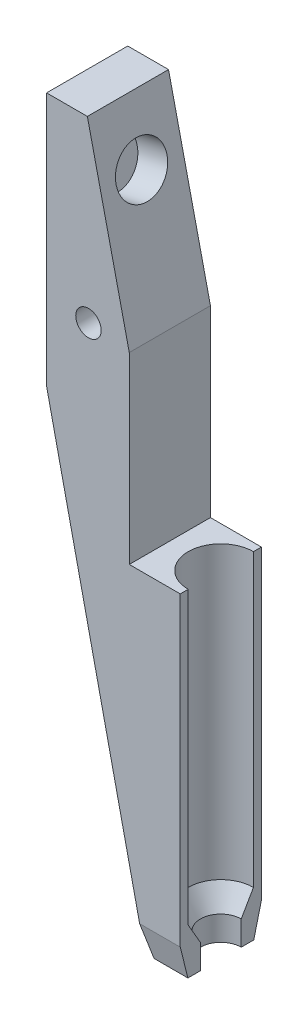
ISO-10303-21;
HEADER;
FILE_DESCRIPTION(('STEP AP214'),'2;1');
FILE_NAME('part.step','',(''),(''),'','','');
FILE_SCHEMA(('AUTOMOTIVE_DESIGN { 1 0 10303 214 1 1 1 1 }'));
ENDSEC;
DATA;
#1=APPLICATION_CONTEXT('core data for automotive mechanical design processes');
#2=APPLICATION_PROTOCOL_DEFINITION('international standard','automotive_design',2000,#1);
#3=PRODUCT_CONTEXT('',#1,'mechanical');
#4=PRODUCT('Part','Part','',(#3));
#5=PRODUCT_RELATED_PRODUCT_CATEGORY('part','',(#4));
#6=PRODUCT_DEFINITION_FORMATION('','',#4);
#7=PRODUCT_DEFINITION_CONTEXT('part definition',#1,'design');
#8=PRODUCT_DEFINITION('design','',#6,#7);
#9=PRODUCT_DEFINITION_SHAPE('','',#8);
#10=(LENGTH_UNIT() NAMED_UNIT(*) SI_UNIT(.MILLI.,.METRE.));
#11=(NAMED_UNIT(*) PLANE_ANGLE_UNIT() SI_UNIT($,.RADIAN.));
#12=(NAMED_UNIT(*) SI_UNIT($,.STERADIAN.) SOLID_ANGLE_UNIT());
#13=UNCERTAINTY_MEASURE_WITH_UNIT(LENGTH_MEASURE(1.E-05),#10,'distance_accuracy_value','');
#14=(GEOMETRIC_REPRESENTATION_CONTEXT(3) GLOBAL_UNCERTAINTY_ASSIGNED_CONTEXT((#13)) GLOBAL_UNIT_ASSIGNED_CONTEXT((#10,
#11,#12)) REPRESENTATION_CONTEXT('',''));
#15=CARTESIAN_POINT('',(0.,0.,0.));
#16=DIRECTION('',(0.,0.,1.));
#17=DIRECTION('',(1.,0.,0.));
#18=AXIS2_PLACEMENT_3D('',#15,#16,#17);
#19=CARTESIAN_POINT('',(1642.37956625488,520.73405558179,3.98));
#20=DIRECTION('',(0.974924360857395,0.222536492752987,0.));
#21=DIRECTION('',(-0.222536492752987,0.974924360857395,0.));
#22=AXIS2_PLACEMENT_3D('',#19,#20,#21);
#23=PLANE('',#22);
#24=CARTESIAN_POINT('',(1642.37956625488,520.734055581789,3.98));
#25=DIRECTION('',(0.974924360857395,0.222536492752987,0.));
#26=DIRECTION('',(-0.222536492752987,0.974924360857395,0.));
#27=AXIS2_PLACEMENT_3D('',#24,#25,#26);
#28=CIRCLE('',#27,2.5);
#29=CARTESIAN_POINT('',(1641.823225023,523.171366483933,3.98));
#30=VERTEX_POINT('',#29);
#31=EDGE_CURVE('E178',#30,#30,#28,.T.);
#32=ORIENTED_EDGE('',*,*,#31,.T.);
#33=EDGE_LOOP('',(#32));
#34=FACE_BOUND('',#33,.T.);
#35=ADVANCED_FACE('F16',(#34),#23,.T.);
#36=CARTESIAN_POINT('',(1653.07780514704,0.,7.96));
#37=DIRECTION('',(-1.,0.,0.));
#38=DIRECTION('',(0.,0.,1.));
#39=AXIS2_PLACEMENT_3D('',#36,#37,#38);
#40=PLANE('',#39);
#41=DIRECTION('',(0.,0.866025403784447,-0.499999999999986));
#42=VECTOR('',#41,1.);
#43=CARTESIAN_POINT('',(1653.07780514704,460.220122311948,2.23));
#44=LINE('',#43,#42);
#45=CARTESIAN_POINT('',(1653.07780514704,460.653135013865,1.97999999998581));
#46=VERTEX_POINT('',#45);
#47=CARTESIAN_POINT('',(1653.07780514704,462.731595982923,0.77999999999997));
#48=VERTEX_POINT('',#47);
#49=EDGE_CURVE('E19',#46,#48,#44,.T.);
#50=ORIENTED_EDGE('',*,*,#49,.F.);
#51=DIRECTION('',(0.,-1.,0.));
#52=VECTOR('',#51,1.);
#53=CARTESIAN_POINT('',(1653.07780514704,468.251211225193,1.97999999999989));
#54=LINE('',#53,#52);
#55=CARTESIAN_POINT('',(1653.07780514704,458.251211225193,1.97999999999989));
#56=VERTEX_POINT('',#55);
#57=EDGE_CURVE('E379',#46,#56,#54,.T.);
#58=ORIENTED_EDGE('',*,*,#57,.T.);
#59=DIRECTION('',(0.,0.,1.));
#60=VECTOR('',#59,1.);
#61=CARTESIAN_POINT('',(1653.07780514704,458.251211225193,7.96));
#62=LINE('',#61,#60);
#63=CARTESIAN_POINT('',(1653.07780514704,458.251211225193,0.749999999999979));
#64=VERTEX_POINT('',#63);
#65=EDGE_CURVE('E168',#64,#56,#62,.T.);
#66=ORIENTED_EDGE('',*,*,#65,.F.);
#67=DIRECTION('',(0.,-0.970142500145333,0.242535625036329));
#68=VECTOR('',#67,1.);
#69=CARTESIAN_POINT('',(1653.07780514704,457.251211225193,1.));
#70=LINE('',#69,#68);
#71=CARTESIAN_POINT('',(1653.07780514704,461.251211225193,0.));
#72=VERTEX_POINT('',#71);
#73=EDGE_CURVE('E153',#64,#72,#70,.F.);
#74=ORIENTED_EDGE('',*,*,#73,.T.);
#75=DIRECTION('',(0.,1.,0.));
#76=VECTOR('',#75,1.);
#77=CARTESIAN_POINT('',(1653.07780514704,0.,0.));
#78=LINE('',#77,#76);
#79=CARTESIAN_POINT('',(1653.07780514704,491.251211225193,0.));
#80=VERTEX_POINT('',#79);
#81=EDGE_CURVE('E152',#72,#80,#78,.T.);
#82=ORIENTED_EDGE('',*,*,#81,.T.);
#83=DIRECTION('',(0.,0.,1.));
#84=VECTOR('',#83,1.);
#85=CARTESIAN_POINT('',(1653.07780514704,491.251211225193,7.96));
#86=LINE('',#85,#84);
#87=CARTESIAN_POINT('',(1653.07780514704,491.251211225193,0.77999999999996));
#88=VERTEX_POINT('',#87);
#89=EDGE_CURVE('E210',#88,#80,#86,.F.);
#90=ORIENTED_EDGE('',*,*,#89,.F.);
#91=DIRECTION('',(0.,1.,0.));
#92=VECTOR('',#91,1.);
#93=CARTESIAN_POINT('',(1653.07780514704,483.251211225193,0.77999999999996));
#94=LINE('',#93,#92);
#95=EDGE_CURVE('E123',#88,#48,#94,.F.);
#96=ORIENTED_EDGE('',*,*,#95,.T.);
#97=EDGE_LOOP('',(#50,#58,#66,#74,#82,#90,#96));
#98=FACE_BOUND('',#97,.T.);
#99=ADVANCED_FACE('F282',(#98),#40,.F.);
#100=CARTESIAN_POINT('',(1653.07780514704,462.731595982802,3.98));
#101=DIRECTION('',(0.,1.,0.));
#102=DIRECTION('',(0.,0.,1.));
#103=AXIS2_PLACEMENT_3D('',#100,#101,#102);
#104=CONICAL_SURFACE('',#103,3.19999999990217,0.523598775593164);
#105=DIRECTION('',(0.,-0.866025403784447,-0.499999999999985));
#106=VECTOR('',#105,1.);
#107=CARTESIAN_POINT('',(1653.07780514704,462.731595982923,7.18));
#108=LINE('',#107,#106);
#109=CARTESIAN_POINT('',(1653.07780514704,462.731595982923,7.18000000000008));
#110=VERTEX_POINT('',#109);
#111=CARTESIAN_POINT('',(1653.07780514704,460.65313501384,5.9800000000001));
#112=VERTEX_POINT('',#111);
#113=EDGE_CURVE('E135',#110,#112,#108,.T.);
#114=ORIENTED_EDGE('',*,*,#113,.T.);
#115=CARTESIAN_POINT('',(1653.07780514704,460.653135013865,3.98));
#116=DIRECTION('',(0.,1.,0.));
#117=DIRECTION('',(0.,0.,1.));
#118=AXIS2_PLACEMENT_3D('',#115,#116,#117);
#119=CIRCLE('',#118,2.0000000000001);
#120=EDGE_CURVE('E32',#112,#46,#119,.F.);
#121=ORIENTED_EDGE('',*,*,#120,.T.);
#122=ORIENTED_EDGE('',*,*,#49,.T.);
#123=CARTESIAN_POINT('',(1653.07780514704,462.731595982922,3.98));
#124=DIRECTION('',(0.,1.,0.));
#125=DIRECTION('',(0.,0.,1.));
#126=AXIS2_PLACEMENT_3D('',#123,#124,#125);
#127=CIRCLE('',#126,3.20000000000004);
#128=EDGE_CURVE('E167',#48,#110,#127,.T.);
#129=ORIENTED_EDGE('',*,*,#128,.T.);
#130=EDGE_LOOP('',(#114,#121,#122,#129));
#131=FACE_BOUND('',#130,.T.);
#132=ADVANCED_FACE('F335',(#131),#104,.F.);
#133=CARTESIAN_POINT('',(1653.07780514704,483.251211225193,3.98));
#134=DIRECTION('',(0.,1.,0.));
#135=DIRECTION('',(0.,0.,1.));
#136=AXIS2_PLACEMENT_3D('',#133,#134,#135);
#137=CYLINDRICAL_SURFACE('',#136,3.20000000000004);
#138=ORIENTED_EDGE('',*,*,#128,.F.);
#139=ORIENTED_EDGE('',*,*,#95,.F.);
#140=CARTESIAN_POINT('',(1653.07780514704,491.251211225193,3.98));
#141=DIRECTION('',(0.,1.,0.));
#142=DIRECTION('',(0.,0.,1.));
#143=AXIS2_PLACEMENT_3D('',#140,#141,#142);
#144=CIRCLE('',#143,3.20000000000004);
#145=CARTESIAN_POINT('',(1653.07780514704,491.251211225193,7.18));
#146=VERTEX_POINT('',#145);
#147=EDGE_CURVE('E116',#88,#146,#144,.T.);
#148=ORIENTED_EDGE('',*,*,#147,.T.);
#149=DIRECTION('',(0.,1.,0.));
#150=VECTOR('',#149,1.);
#151=CARTESIAN_POINT('',(1653.07780514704,0.,7.18));
#152=LINE('',#151,#150);
#153=EDGE_CURVE('E120',#146,#110,#152,.F.);
#154=ORIENTED_EDGE('',*,*,#153,.T.);
#155=EDGE_LOOP('',(#138,#139,#148,#154));
#156=FACE_BOUND('',#155,.T.);
#157=ADVANCED_FACE('F119',(#156),#137,.F.);
#158=CARTESIAN_POINT('',(1642.37956625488,520.73405558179,3.98));
#159=DIRECTION('',(0.974924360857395,0.222536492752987,0.));
#160=DIRECTION('',(-0.222536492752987,0.974924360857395,0.));
#161=AXIS2_PLACEMENT_3D('',#158,#159,#160);
#162=CYLINDRICAL_SURFACE('',#161,2.5);
#163=ORIENTED_EDGE('',*,*,#31,.F.);
#164=EDGE_LOOP('',(#163));
#165=FACE_BOUND('',#164,.T.);
#166=CARTESIAN_POINT('',(1645.30433933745,521.401665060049,3.98));
#167=DIRECTION('',(0.974924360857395,0.222536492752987,0.));
#168=DIRECTION('',(-0.222536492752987,0.974924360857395,0.));
#169=AXIS2_PLACEMENT_3D('',#166,#167,#168);
#170=CIRCLE('',#169,2.5);
#171=CARTESIAN_POINT('',(1644.74799810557,523.838975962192,3.98));
#172=VERTEX_POINT('',#171);
#173=EDGE_CURVE('E185',#172,#172,#170,.T.);
#174=ORIENTED_EDGE('',*,*,#173,.T.);
#175=EDGE_LOOP('',(#174));
#176=FACE_BOUND('',#175,.T.);
#177=ADVANCED_FACE('F338',(#165,#176),#162,.F.);
#178=CARTESIAN_POINT('',(0.,457.251211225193,1.));
#179=DIRECTION('',(0.,0.242535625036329,0.970142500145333));
#180=DIRECTION('',(0.,-0.970142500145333,0.242535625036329));
#181=AXIS2_PLACEMENT_3D('',#178,#179,#180);
#182=PLANE('',#181);
#183=DIRECTION('',(1.,0.,0.));
#184=VECTOR('',#183,1.);
#185=CARTESIAN_POINT('',(0.,461.251211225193,0.));
#186=LINE('',#185,#184);
#187=CARTESIAN_POINT('',(1649.09416694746,461.251211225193,0.));
#188=VERTEX_POINT('',#187);
#189=EDGE_CURVE('E150',#188,#72,#186,.T.);
#190=ORIENTED_EDGE('',*,*,#189,.T.);
#191=ORIENTED_EDGE('',*,*,#73,.F.);
#192=DIRECTION('',(1.,0.,0.));
#193=VECTOR('',#192,1.);
#194=CARTESIAN_POINT('',(0.,458.251211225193,0.749999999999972));
#195=LINE('',#194,#193);
#196=CARTESIAN_POINT('',(1649.76051713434,458.251211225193,0.75));
#197=VERTEX_POINT('',#196);
#198=EDGE_CURVE('E183',#64,#197,#195,.F.);
#199=ORIENTED_EDGE('',*,*,#198,.T.);
#200=DIRECTION('',(-0.210649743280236,0.948374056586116,-0.237093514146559));
#201=VECTOR('',#200,1.);
#202=CARTESIAN_POINT('',(1649.76051713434,458.251211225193,0.750000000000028));
#203=LINE('',#202,#201);
#204=EDGE_CURVE('E252',#197,#188,#203,.T.);
#205=ORIENTED_EDGE('',*,*,#204,.T.);
#206=EDGE_LOOP('',(#190,#191,#199,#205));
#207=FACE_BOUND('',#206,.T.);
#208=ADVANCED_FACE('F341',(#207),#182,.F.);
#209=CARTESIAN_POINT('',(0.,0.,0.));
#210=DIRECTION('',(0.,0.,1.));
#211=DIRECTION('',(1.,0.,0.));
#212=AXIS2_PLACEMENT_3D('',#209,#210,#211);
#213=PLANE('',#212);
#214=DIRECTION('',(0.,1.,0.));
#215=VECTOR('',#214,1.);
#216=CARTESIAN_POINT('',(1639.96912038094,0.,0.));
#217=LINE('',#216,#215);
#218=CARTESIAN_POINT('',(1639.96912038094,527.251211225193,0.));
#219=VERTEX_POINT('',#218);
#220=CARTESIAN_POINT('',(1639.96912038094,502.333423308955,0.));
#221=VERTEX_POINT('',#220);
#222=EDGE_CURVE('E257',#219,#221,#217,.F.);
#223=ORIENTED_EDGE('',*,*,#222,.F.);
#224=DIRECTION('',(1.,0.,0.));
#225=VECTOR('',#224,1.);
#226=CARTESIAN_POINT('',(0.,527.251211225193,0.));
#227=LINE('',#226,#225);
#228=CARTESIAN_POINT('',(1643.96912038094,527.251211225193,0.));
#229=VERTEX_POINT('',#228);
#230=EDGE_CURVE('E262',#229,#219,#227,.F.);
#231=ORIENTED_EDGE('',*,*,#230,.F.);
#232=DIRECTION('',(0.222536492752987,-0.974924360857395,0.));
#233=VECTOR('',#232,1.);
#234=CARTESIAN_POINT('',(1676.94611958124,382.78016528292,0.));
#235=LINE('',#234,#233);
#236=CARTESIAN_POINT('',(1648.07780514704,509.251211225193,0.));
#237=VERTEX_POINT('',#236);
#238=EDGE_CURVE('E265',#229,#237,#235,.T.);
#239=ORIENTED_EDGE('',*,*,#238,.T.);
#240=DIRECTION('',(0.,1.,0.));
#241=VECTOR('',#240,1.);
#242=CARTESIAN_POINT('',(1648.07780514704,0.,0.));
#243=LINE('',#242,#241);
#244=CARTESIAN_POINT('',(1648.07780514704,491.251211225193,0.));
#245=VERTEX_POINT('',#244);
#246=EDGE_CURVE('E144',#237,#245,#243,.F.);
#247=ORIENTED_EDGE('',*,*,#246,.T.);
#248=DIRECTION('',(1.,0.,0.));
#249=VECTOR('',#248,1.);
#250=CARTESIAN_POINT('',(0.,491.251211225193,0.));
#251=LINE('',#250,#249);
#252=EDGE_CURVE('E127',#245,#80,#251,.T.);
#253=ORIENTED_EDGE('',*,*,#252,.T.);
#254=ORIENTED_EDGE('',*,*,#81,.F.);
#255=ORIENTED_EDGE('',*,*,#189,.F.);
#256=DIRECTION('',(-0.216832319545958,0.976208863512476,0.));
#257=VECTOR('',#256,1.);
#258=CARTESIAN_POINT('',(1669.19465465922,370.756056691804,0.));
#259=LINE('',#258,#257);
#260=EDGE_CURVE('E250',#188,#221,#259,.T.);
#261=ORIENTED_EDGE('',*,*,#260,.T.);
#262=EDGE_LOOP('',(#223,#231,#239,#247,#253,#254,#255,#261));
#263=FACE_BOUND('',#262,.T.);
#264=CARTESIAN_POINT('',(1644.07780514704,509.751211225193,0.));
#265=DIRECTION('',(0.,0.,-1.));
#266=DIRECTION('',(-1.,0.,0.));
#267=AXIS2_PLACEMENT_3D('',#264,#265,#266);
#268=CIRCLE('',#267,1.24999999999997);
#269=CARTESIAN_POINT('',(1642.82780514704,509.751211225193,0.));
#270=VERTEX_POINT('',#269);
#271=EDGE_CURVE('E181',#270,#270,#268,.F.);
#272=ORIENTED_EDGE('',*,*,#271,.T.);
#273=EDGE_LOOP('',(#272));
#274=FACE_BOUND('',#273,.T.);
#275=ADVANCED_FACE('F271',(#263,#274),#213,.F.);
#276=CARTESIAN_POINT('',(0.,458.251211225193,7.96));
#277=DIRECTION('',(0.,1.,0.));
#278=DIRECTION('',(0.,0.,1.));
#279=AXIS2_PLACEMENT_3D('',#276,#277,#278);
#280=PLANE('',#279);
#281=ORIENTED_EDGE('',*,*,#65,.T.);
#282=CARTESIAN_POINT('',(1653.07780514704,458.251211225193,3.98));
#283=DIRECTION('',(0.,-1.,0.));
#284=DIRECTION('',(0.,0.,-1.));
#285=AXIS2_PLACEMENT_3D('',#282,#283,#284);
#286=CIRCLE('',#285,2.0000000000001);
#287=CARTESIAN_POINT('',(1653.07780514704,458.251211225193,5.9800000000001));
#288=VERTEX_POINT('',#287);
#289=EDGE_CURVE('E381',#288,#56,#286,.T.);
#290=ORIENTED_EDGE('',*,*,#289,.F.);
#291=DIRECTION('',(0.,0.,1.));
#292=VECTOR('',#291,1.);
#293=CARTESIAN_POINT('',(1653.07780514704,458.251211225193,7.96));
#294=LINE('',#293,#292);
#295=CARTESIAN_POINT('',(1653.07780514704,458.251211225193,7.21));
#296=VERTEX_POINT('',#295);
#297=EDGE_CURVE('E175',#288,#296,#294,.T.);
#298=ORIENTED_EDGE('',*,*,#297,.T.);
#299=DIRECTION('',(1.,0.,0.));
#300=VECTOR('',#299,1.);
#301=CARTESIAN_POINT('',(0.,458.251211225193,7.21));
#302=LINE('',#301,#300);
#303=CARTESIAN_POINT('',(1649.76051713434,458.251211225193,7.21));
#304=VERTEX_POINT('',#303);
#305=EDGE_CURVE('E136',#304,#296,#302,.T.);
#306=ORIENTED_EDGE('',*,*,#305,.F.);
#307=DIRECTION('',(0.,0.,1.));
#308=VECTOR('',#307,1.);
#309=CARTESIAN_POINT('',(1649.76051713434,458.251211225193,7.96));
#310=LINE('',#309,#308);
#311=EDGE_CURVE('E192',#304,#197,#310,.F.);
#312=ORIENTED_EDGE('',*,*,#311,.T.);
#313=ORIENTED_EDGE('',*,*,#198,.F.);
#314=EDGE_LOOP('',(#281,#290,#298,#306,#312,#313));
#315=FACE_BOUND('',#314,.T.);
#316=ADVANCED_FACE('F361',(#315),#280,.F.);
#317=CARTESIAN_POINT('',(1644.07780514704,509.751211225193,7.96));
#318=DIRECTION('',(0.,0.,-1.));
#319=DIRECTION('',(-1.,0.,0.));
#320=AXIS2_PLACEMENT_3D('',#317,#318,#319);
#321=CYLINDRICAL_SURFACE('',#320,1.24999999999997);
#322=CARTESIAN_POINT('',(1644.07780514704,509.751211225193,7.96));
#323=DIRECTION('',(0.,0.,-1.));
#324=DIRECTION('',(-1.,0.,0.));
#325=AXIS2_PLACEMENT_3D('',#322,#323,#324);
#326=CIRCLE('',#325,1.24999999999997);
#327=CARTESIAN_POINT('',(1642.82780514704,509.751211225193,7.96));
#328=VERTEX_POINT('',#327);
#329=EDGE_CURVE('E189',#328,#328,#326,.T.);
#330=ORIENTED_EDGE('',*,*,#329,.F.);
#331=EDGE_LOOP('',(#330));
#332=FACE_BOUND('',#331,.T.);
#333=ORIENTED_EDGE('',*,*,#271,.F.);
#334=EDGE_LOOP('',(#333));
#335=FACE_BOUND('',#334,.T.);
#336=ADVANCED_FACE('F358',(#332,#335),#321,.F.);
#337=CARTESIAN_POINT('',(0.,461.251211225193,7.96));
#338=DIRECTION('',(0.,-0.24253562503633,0.970142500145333));
#339=DIRECTION('',(0.,-0.970142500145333,-0.24253562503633));
#340=AXIS2_PLACEMENT_3D('',#337,#338,#339);
#341=PLANE('',#340);
#342=DIRECTION('',(1.,0.,0.));
#343=VECTOR('',#342,1.);
#344=CARTESIAN_POINT('',(0.,461.251211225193,7.96));
#345=LINE('',#344,#343);
#346=CARTESIAN_POINT('',(1649.09416694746,461.251211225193,7.96));
#347=VERTEX_POINT('',#346);
#348=CARTESIAN_POINT('',(1653.07780514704,461.251211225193,7.96));
#349=VERTEX_POINT('',#348);
#350=EDGE_CURVE('E163',#347,#349,#345,.T.);
#351=ORIENTED_EDGE('',*,*,#350,.F.);
#352=DIRECTION('',(0.210649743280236,-0.948374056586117,-0.237093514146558));
#353=VECTOR('',#352,1.);
#354=CARTESIAN_POINT('',(1649.09416694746,461.251211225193,7.96));
#355=LINE('',#354,#353);
#356=EDGE_CURVE('E220',#347,#304,#355,.T.);
#357=ORIENTED_EDGE('',*,*,#356,.T.);
#358=ORIENTED_EDGE('',*,*,#305,.T.);
#359=DIRECTION('',(0.,0.970142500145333,0.24253562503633));
#360=VECTOR('',#359,1.);
#361=CARTESIAN_POINT('',(1653.07780514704,458.251211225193,7.21));
#362=LINE('',#361,#360);
#363=EDGE_CURVE('E177',#296,#349,#362,.T.);
#364=ORIENTED_EDGE('',*,*,#363,.T.);
#365=EDGE_LOOP('',(#351,#357,#358,#364));
#366=FACE_BOUND('',#365,.T.);
#367=ADVANCED_FACE('F237',(#366),#341,.T.);
#368=CARTESIAN_POINT('',(1653.07780514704,0.,7.96));
#369=DIRECTION('',(-1.,0.,0.));
#370=DIRECTION('',(0.,0.,1.));
#371=AXIS2_PLACEMENT_3D('',#368,#369,#370);
#372=PLANE('',#371);
#373=ORIENTED_EDGE('',*,*,#297,.F.);
#374=DIRECTION('',(0.,-1.,0.));
#375=VECTOR('',#374,1.);
#376=CARTESIAN_POINT('',(1653.07780514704,468.251211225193,5.9800000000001));
#377=LINE('',#376,#375);
#378=EDGE_CURVE('E11',#288,#112,#377,.F.);
#379=ORIENTED_EDGE('',*,*,#378,.T.);
#380=ORIENTED_EDGE('',*,*,#113,.F.);
#381=ORIENTED_EDGE('',*,*,#153,.F.);
#382=DIRECTION('',(0.,0.,-1.));
#383=VECTOR('',#382,1.);
#384=CARTESIAN_POINT('',(1653.07780514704,491.251211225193,7.96));
#385=LINE('',#384,#383);
#386=CARTESIAN_POINT('',(1653.07780514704,491.251211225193,7.96));
#387=VERTEX_POINT('',#386);
#388=EDGE_CURVE('E126',#146,#387,#385,.F.);
#389=ORIENTED_EDGE('',*,*,#388,.T.);
#390=DIRECTION('',(0.,1.,0.));
#391=VECTOR('',#390,1.);
#392=CARTESIAN_POINT('',(1653.07780514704,0.,7.96));
#393=LINE('',#392,#391);
#394=EDGE_CURVE('E159',#349,#387,#393,.T.);
#395=ORIENTED_EDGE('',*,*,#394,.F.);
#396=ORIENTED_EDGE('',*,*,#363,.F.);
#397=EDGE_LOOP('',(#373,#379,#380,#381,#389,#395,#396));
#398=FACE_BOUND('',#397,.T.);
#399=ADVANCED_FACE('F131',(#398),#372,.F.);
#400=CARTESIAN_POINT('',(0.,491.251211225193,7.96));
#401=DIRECTION('',(0.,-1.,0.));
#402=DIRECTION('',(0.,0.,-1.));
#403=AXIS2_PLACEMENT_3D('',#400,#401,#402);
#404=PLANE('',#403);
#405=ORIENTED_EDGE('',*,*,#147,.F.);
#406=ORIENTED_EDGE('',*,*,#89,.T.);
#407=ORIENTED_EDGE('',*,*,#252,.F.);
#408=DIRECTION('',(0.,0.,1.));
#409=VECTOR('',#408,1.);
#410=CARTESIAN_POINT('',(1648.07780514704,491.251211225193,7.96));
#411=LINE('',#410,#409);
#412=CARTESIAN_POINT('',(1648.07780514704,491.251211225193,7.96));
#413=VERTEX_POINT('',#412);
#414=EDGE_CURVE('E142',#245,#413,#411,.T.);
#415=ORIENTED_EDGE('',*,*,#414,.T.);
#416=DIRECTION('',(1.,0.,0.));
#417=VECTOR('',#416,1.);
#418=CARTESIAN_POINT('',(0.,491.251211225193,7.96));
#419=LINE('',#418,#417);
#420=EDGE_CURVE('E140',#387,#413,#419,.F.);
#421=ORIENTED_EDGE('',*,*,#420,.F.);
#422=ORIENTED_EDGE('',*,*,#388,.F.);
#423=EDGE_LOOP('',(#405,#406,#407,#415,#421,#422));
#424=FACE_BOUND('',#423,.T.);
#425=ADVANCED_FACE('F138',(#424),#404,.F.);
#426=CARTESIAN_POINT('',(1648.07780514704,0.,7.96));
#427=DIRECTION('',(-1.,0.,0.));
#428=DIRECTION('',(0.,0.,1.));
#429=AXIS2_PLACEMENT_3D('',#426,#427,#428);
#430=PLANE('',#429);
#431=DIRECTION('',(0.,0.,1.));
#432=VECTOR('',#431,1.);
#433=CARTESIAN_POINT('',(1648.07780514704,509.251211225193,7.96));
#434=LINE('',#433,#432);
#435=CARTESIAN_POINT('',(1648.07780514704,509.251211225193,7.96));
#436=VERTEX_POINT('',#435);
#437=EDGE_CURVE('E188',#237,#436,#434,.T.);
#438=ORIENTED_EDGE('',*,*,#437,.T.);
#439=DIRECTION('',(0.,1.,0.));
#440=VECTOR('',#439,1.);
#441=CARTESIAN_POINT('',(1648.07780514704,0.,7.96));
#442=LINE('',#441,#440);
#443=EDGE_CURVE('E158',#413,#436,#442,.T.);
#444=ORIENTED_EDGE('',*,*,#443,.F.);
#445=ORIENTED_EDGE('',*,*,#414,.F.);
#446=ORIENTED_EDGE('',*,*,#246,.F.);
#447=EDGE_LOOP('',(#438,#444,#445,#446));
#448=FACE_BOUND('',#447,.T.);
#449=ADVANCED_FACE('F278',(#448),#430,.F.);
#450=CARTESIAN_POINT('',(1676.94611958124,382.78016528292,7.96));
#451=DIRECTION('',(-0.974924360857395,-0.222536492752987,0.));
#452=DIRECTION('',(0.222536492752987,-0.974924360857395,0.));
#453=AXIS2_PLACEMENT_3D('',#450,#451,#452);
#454=PLANE('',#453);
#455=DIRECTION('',(0.,0.,1.));
#456=VECTOR('',#455,1.);
#457=CARTESIAN_POINT('',(1643.96912038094,527.251211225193,7.96));
#458=LINE('',#457,#456);
#459=CARTESIAN_POINT('',(1643.96912038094,527.251211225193,7.96));
#460=VERTEX_POINT('',#459);
#461=EDGE_CURVE('E259',#460,#229,#458,.F.);
#462=ORIENTED_EDGE('',*,*,#461,.F.);
#463=DIRECTION('',(-0.222536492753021,0.974924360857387,0.));
#464=VECTOR('',#463,1.);
#465=CARTESIAN_POINT('',(1648.07780514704,509.251211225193,7.96));
#466=LINE('',#465,#464);
#467=EDGE_CURVE('E298',#436,#460,#466,.T.);
#468=ORIENTED_EDGE('',*,*,#467,.F.);
#469=ORIENTED_EDGE('',*,*,#437,.F.);
#470=ORIENTED_EDGE('',*,*,#238,.F.);
#471=EDGE_LOOP('',(#462,#468,#469,#470));
#472=FACE_BOUND('',#471,.T.);
#473=ORIENTED_EDGE('',*,*,#173,.F.);
#474=EDGE_LOOP('',(#473));
#475=FACE_BOUND('',#474,.T.);
#476=ADVANCED_FACE('F303',(#472,#475),#454,.F.);
#477=CARTESIAN_POINT('',(0.,527.251211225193,7.96));
#478=DIRECTION('',(0.,1.,0.));
#479=DIRECTION('',(0.,0.,1.));
#480=AXIS2_PLACEMENT_3D('',#477,#478,#479);
#481=PLANE('',#480);
#482=DIRECTION('',(1.,0.,0.));
#483=VECTOR('',#482,1.);
#484=CARTESIAN_POINT('',(0.,527.251211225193,7.96));
#485=LINE('',#484,#483);
#486=CARTESIAN_POINT('',(1639.96912038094,527.251211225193,7.96));
#487=VERTEX_POINT('',#486);
#488=EDGE_CURVE('E296',#460,#487,#485,.F.);
#489=ORIENTED_EDGE('',*,*,#488,.F.);
#490=ORIENTED_EDGE('',*,*,#461,.T.);
#491=ORIENTED_EDGE('',*,*,#230,.T.);
#492=DIRECTION('',(0.,0.,1.));
#493=VECTOR('',#492,1.);
#494=CARTESIAN_POINT('',(1639.96912038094,527.251211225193,7.96));
#495=LINE('',#494,#493);
#496=EDGE_CURVE('E254',#487,#219,#495,.F.);
#497=ORIENTED_EDGE('',*,*,#496,.F.);
#498=EDGE_LOOP('',(#489,#490,#491,#497));
#499=FACE_BOUND('',#498,.T.);
#500=ADVANCED_FACE('F306',(#499),#481,.T.);
#501=CARTESIAN_POINT('',(1639.96912038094,0.,7.96));
#502=DIRECTION('',(-1.,0.,0.));
#503=DIRECTION('',(0.,0.,1.));
#504=AXIS2_PLACEMENT_3D('',#501,#502,#503);
#505=PLANE('',#504);
#506=DIRECTION('',(0.,1.,0.));
#507=VECTOR('',#506,1.);
#508=CARTESIAN_POINT('',(1639.96912038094,0.,7.96));
#509=LINE('',#508,#507);
#510=CARTESIAN_POINT('',(1639.96912038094,502.333423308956,7.96));
#511=VERTEX_POINT('',#510);
#512=EDGE_CURVE('E291',#487,#511,#509,.F.);
#513=ORIENTED_EDGE('',*,*,#512,.F.);
#514=ORIENTED_EDGE('',*,*,#496,.T.);
#515=ORIENTED_EDGE('',*,*,#222,.T.);
#516=DIRECTION('',(0.,0.,1.));
#517=VECTOR('',#516,1.);
#518=CARTESIAN_POINT('',(1639.96912038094,502.333423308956,7.96));
#519=LINE('',#518,#517);
#520=EDGE_CURVE('E40',#221,#511,#519,.T.);
#521=ORIENTED_EDGE('',*,*,#520,.T.);
#522=EDGE_LOOP('',(#513,#514,#515,#521));
#523=FACE_BOUND('',#522,.T.);
#524=ADVANCED_FACE('F307',(#523),#505,.T.);
#525=CARTESIAN_POINT('',(1669.19465465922,370.756056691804,7.96));
#526=DIRECTION('',(0.976208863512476,0.216832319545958,0.));
#527=DIRECTION('',(-0.216832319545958,0.976208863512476,0.));
#528=AXIS2_PLACEMENT_3D('',#525,#526,#527);
#529=PLANE('',#528);
#530=ORIENTED_EDGE('',*,*,#356,.F.);
#531=DIRECTION('',(0.216832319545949,-0.976208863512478,0.));
#532=VECTOR('',#531,1.);
#533=CARTESIAN_POINT('',(1639.96912038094,502.333423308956,7.96));
#534=LINE('',#533,#532);
#535=EDGE_CURVE('E25',#511,#347,#534,.T.);
#536=ORIENTED_EDGE('',*,*,#535,.F.);
#537=ORIENTED_EDGE('',*,*,#520,.F.);
#538=ORIENTED_EDGE('',*,*,#260,.F.);
#539=ORIENTED_EDGE('',*,*,#204,.F.);
#540=ORIENTED_EDGE('',*,*,#311,.F.);
#541=EDGE_LOOP('',(#530,#536,#537,#538,#539,#540));
#542=FACE_BOUND('',#541,.T.);
#543=ADVANCED_FACE('F289',(#542),#529,.F.);
#544=CARTESIAN_POINT('',(0.,0.,7.96));
#545=DIRECTION('',(0.,0.,1.));
#546=DIRECTION('',(1.,0.,0.));
#547=AXIS2_PLACEMENT_3D('',#544,#545,#546);
#548=PLANE('',#547);
#549=ORIENTED_EDGE('',*,*,#512,.T.);
#550=ORIENTED_EDGE('',*,*,#535,.T.);
#551=ORIENTED_EDGE('',*,*,#350,.T.);
#552=ORIENTED_EDGE('',*,*,#394,.T.);
#553=ORIENTED_EDGE('',*,*,#420,.T.);
#554=ORIENTED_EDGE('',*,*,#443,.T.);
#555=ORIENTED_EDGE('',*,*,#467,.T.);
#556=ORIENTED_EDGE('',*,*,#488,.T.);
#557=EDGE_LOOP('',(#549,#550,#551,#552,#553,#554,#555,#556));
#558=FACE_BOUND('',#557,.T.);
#559=ORIENTED_EDGE('',*,*,#329,.T.);
#560=EDGE_LOOP('',(#559));
#561=FACE_BOUND('',#560,.T.);
#562=ADVANCED_FACE('F243',(#558,#561),#548,.T.);
#563=CARTESIAN_POINT('',(1653.07780514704,468.251211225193,3.98));
#564=DIRECTION('',(0.,-1.,0.));
#565=DIRECTION('',(0.,0.,-1.));
#566=AXIS2_PLACEMENT_3D('',#563,#564,#565);
#567=CYLINDRICAL_SURFACE('',#566,2.0000000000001);
#568=ORIENTED_EDGE('',*,*,#120,.F.);
#569=ORIENTED_EDGE('',*,*,#378,.F.);
#570=ORIENTED_EDGE('',*,*,#289,.T.);
#571=ORIENTED_EDGE('',*,*,#57,.F.);
#572=EDGE_LOOP('',(#568,#569,#570,#571));
#573=FACE_BOUND('',#572,.T.);
#574=ADVANCED_FACE('F319',(#573),#567,.F.);
#575=CLOSED_SHELL('',(#35,#99,#132,#157,#177,#208,#275,#316,#336,#367,#399,#425,#449,#476,#500,
#524,#543,#562,#574));
#576=MANIFOLD_SOLID_BREP('B1',#575);
#577=ADVANCED_BREP_SHAPE_REPRESENTATION('',(#18,#576),#14);
#578=SHAPE_DEFINITION_REPRESENTATION(#9,#577);
ENDSEC;
END-ISO-10303-21;
